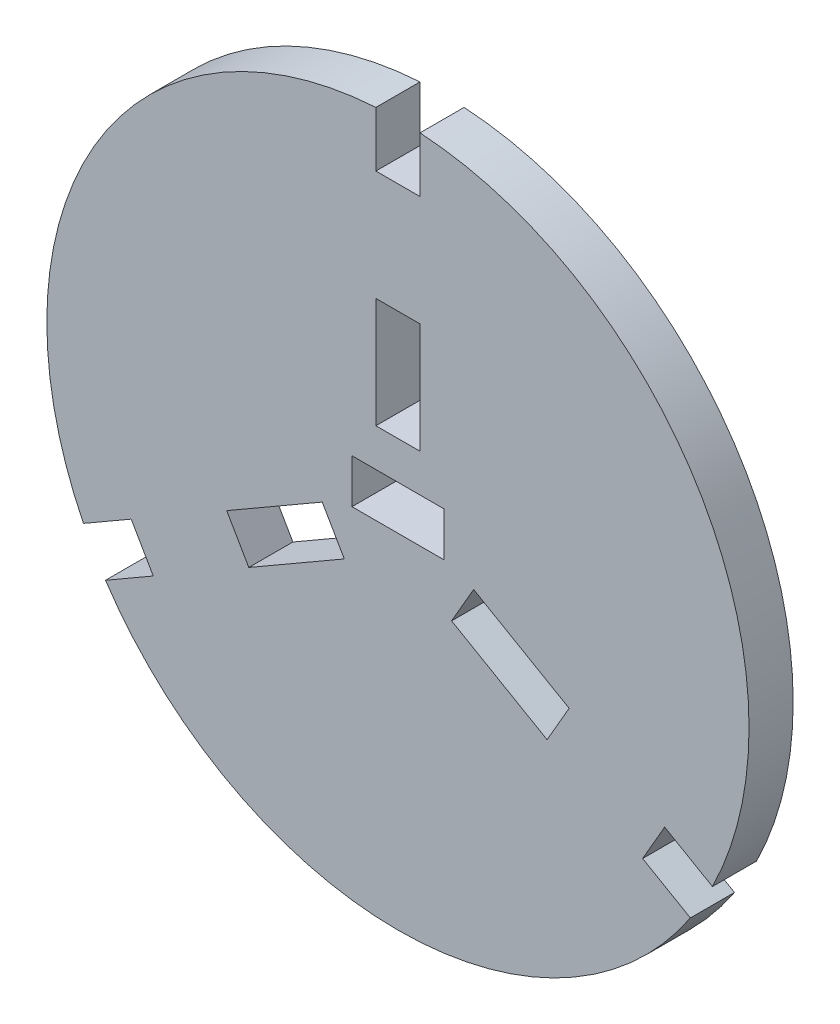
ISO-10303-21;
HEADER;
FILE_DESCRIPTION(('STEP AP214'),'2;1');
FILE_NAME('part.step','',(''),(''),'','','');
FILE_SCHEMA(('AUTOMOTIVE_DESIGN { 1 0 10303 214 1 1 1 1 }'));
ENDSEC;
DATA;
#1=APPLICATION_CONTEXT('core data for automotive mechanical design processes');
#2=APPLICATION_PROTOCOL_DEFINITION('international standard','automotive_design',2000,#1);
#3=PRODUCT_CONTEXT('',#1,'mechanical');
#4=PRODUCT('Part','Part','',(#3));
#5=PRODUCT_RELATED_PRODUCT_CATEGORY('part','',(#4));
#6=PRODUCT_DEFINITION_FORMATION('','',#4);
#7=PRODUCT_DEFINITION_CONTEXT('part definition',#1,'design');
#8=PRODUCT_DEFINITION('design','',#6,#7);
#9=PRODUCT_DEFINITION_SHAPE('','',#8);
#10=(LENGTH_UNIT() NAMED_UNIT(*) SI_UNIT(.MILLI.,.METRE.));
#11=(NAMED_UNIT(*) PLANE_ANGLE_UNIT() SI_UNIT($,.RADIAN.));
#12=(NAMED_UNIT(*) SI_UNIT($,.STERADIAN.) SOLID_ANGLE_UNIT());
#13=UNCERTAINTY_MEASURE_WITH_UNIT(LENGTH_MEASURE(1.E-05),#10,'distance_accuracy_value','');
#14=(GEOMETRIC_REPRESENTATION_CONTEXT(3) GLOBAL_UNCERTAINTY_ASSIGNED_CONTEXT((#13)) GLOBAL_UNIT_ASSIGNED_CONTEXT((#10,
#11,#12)) REPRESENTATION_CONTEXT('',''));
#15=CARTESIAN_POINT('',(0.,0.,0.));
#16=DIRECTION('',(0.,0.,1.));
#17=DIRECTION('',(1.,0.,0.));
#18=AXIS2_PLACEMENT_3D('',#15,#16,#17);
#19=CARTESIAN_POINT('',(0.,0.,12.));
#20=DIRECTION('',(0.,0.,1.));
#21=DIRECTION('',(1.,0.,0.));
#22=AXIS2_PLACEMENT_3D('',#19,#20,#21);
#23=PLANE('',#22);
#24=DIRECTION('',(0.,1.,0.));
#25=VECTOR('',#24,1.);
#26=CARTESIAN_POINT('',(12.5,10.,12.));
#27=LINE('',#26,#25);
#28=CARTESIAN_POINT('',(12.5,-2.,12.));
#29=VERTEX_POINT('',#28);
#30=CARTESIAN_POINT('',(12.5,10.,12.));
#31=VERTEX_POINT('',#30);
#32=EDGE_CURVE('E58',#29,#31,#27,.T.);
#33=ORIENTED_EDGE('',*,*,#32,.F.);
#34=DIRECTION('',(1.,0.,0.));
#35=VECTOR('',#34,1.);
#36=CARTESIAN_POINT('',(-12.5,-2.,12.));
#37=LINE('',#36,#35);
#38=CARTESIAN_POINT('',(-12.5,-2.,12.));
#39=VERTEX_POINT('',#38);
#40=EDGE_CURVE('E246',#39,#29,#37,.T.);
#41=ORIENTED_EDGE('',*,*,#40,.F.);
#42=DIRECTION('',(0.,-1.,0.));
#43=VECTOR('',#42,1.);
#44=CARTESIAN_POINT('',(-12.5,10.,12.));
#45=LINE('',#44,#43);
#46=CARTESIAN_POINT('',(-12.5,10.,12.));
#47=VERTEX_POINT('',#46);
#48=EDGE_CURVE('E231',#47,#39,#45,.T.);
#49=ORIENTED_EDGE('',*,*,#48,.F.);
#50=DIRECTION('',(-1.,0.,0.));
#51=VECTOR('',#50,1.);
#52=CARTESIAN_POINT('',(-12.5,10.,12.));
#53=LINE('',#52,#51);
#54=EDGE_CURVE('E240',#31,#47,#53,.T.);
#55=ORIENTED_EDGE('',*,*,#54,.F.);
#56=EDGE_LOOP('',(#33,#41,#49,#55));
#57=FACE_BOUND('',#56,.T.);
#58=CARTESIAN_POINT('',(0.,0.,12.));
#59=DIRECTION('',(0.,0.,1.));
#60=DIRECTION('',(1.,0.,0.));
#61=AXIS2_PLACEMENT_3D('',#58,#59,#60);
#62=CIRCLE('',#61,95.5);
#63=CARTESIAN_POINT('',(-6.,95.311331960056,12.));
#64=VERTEX_POINT('',#63);
#65=CARTESIAN_POINT('',(-85.5420347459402,-42.4595135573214,12.));
#66=VERTEX_POINT('',#65);
#67=EDGE_CURVE('E349',#64,#66,#62,.T.);
#68=ORIENTED_EDGE('',*,*,#67,.T.);
#69=DIRECTION('',(0.866025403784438,0.500000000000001,0.));
#70=VECTOR('',#69,1.);
#71=CARTESIAN_POINT('',(-85.5420347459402,-42.4595135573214,12.));
#72=LINE('',#71,#70);
#73=CARTESIAN_POINT('',(-72.5516536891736,-34.9595135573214,12.));
#74=VERTEX_POINT('',#73);
#75=EDGE_CURVE('E352',#66,#74,#72,.T.);
#76=ORIENTED_EDGE('',*,*,#75,.T.);
#77=DIRECTION('',(0.5,-0.866025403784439,0.));
#78=VECTOR('',#77,1.);
#79=CARTESIAN_POINT('',(-66.5516536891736,-45.3518184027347,12.));
#80=LINE('',#79,#78);
#81=CARTESIAN_POINT('',(-66.5516536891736,-45.3518184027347,12.));
#82=VERTEX_POINT('',#81);
#83=EDGE_CURVE('E355',#74,#82,#80,.T.);
#84=ORIENTED_EDGE('',*,*,#83,.T.);
#85=DIRECTION('',(-0.866025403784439,-0.5,0.));
#86=VECTOR('',#85,1.);
#87=CARTESIAN_POINT('',(-79.5420347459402,-52.8518184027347,12.));
#88=LINE('',#87,#86);
#89=CARTESIAN_POINT('',(-79.5420347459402,-52.8518184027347,12.));
#90=VERTEX_POINT('',#89);
#91=EDGE_CURVE('E357',#82,#90,#88,.T.);
#92=ORIENTED_EDGE('',*,*,#91,.T.);
#93=CARTESIAN_POINT('',(0.,0.,12.));
#94=DIRECTION('',(0.,0.,1.));
#95=DIRECTION('',(1.,0.,0.));
#96=AXIS2_PLACEMENT_3D('',#93,#94,#95);
#97=CIRCLE('',#96,95.5);
#98=CARTESIAN_POINT('',(79.5420347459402,-52.8518184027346,12.));
#99=VERTEX_POINT('',#98);
#100=EDGE_CURVE('E359',#90,#99,#97,.T.);
#101=ORIENTED_EDGE('',*,*,#100,.T.);
#102=DIRECTION('',(-0.866025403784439,0.5,0.));
#103=VECTOR('',#102,1.);
#104=CARTESIAN_POINT('',(79.5420347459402,-52.8518184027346,12.));
#105=LINE('',#104,#103);
#106=CARTESIAN_POINT('',(66.5516536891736,-45.3518184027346,12.));
#107=VERTEX_POINT('',#106);
#108=EDGE_CURVE('E361',#99,#107,#105,.T.);
#109=ORIENTED_EDGE('',*,*,#108,.T.);
#110=DIRECTION('',(0.5,0.866025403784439,0.));
#111=VECTOR('',#110,1.);
#112=CARTESIAN_POINT('',(72.5516536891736,-34.9595135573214,12.));
#113=LINE('',#112,#111);
#114=CARTESIAN_POINT('',(72.5516536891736,-34.9595135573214,12.));
#115=VERTEX_POINT('',#114);
#116=EDGE_CURVE('E363',#107,#115,#113,.T.);
#117=ORIENTED_EDGE('',*,*,#116,.T.);
#118=DIRECTION('',(0.866025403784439,-0.499999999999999,0.));
#119=VECTOR('',#118,1.);
#120=CARTESIAN_POINT('',(85.5420347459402,-42.4595135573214,12.));
#121=LINE('',#120,#119);
#122=CARTESIAN_POINT('',(85.5420347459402,-42.4595135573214,12.));
#123=VERTEX_POINT('',#122);
#124=EDGE_CURVE('E365',#115,#123,#121,.T.);
#125=ORIENTED_EDGE('',*,*,#124,.T.);
#126=CARTESIAN_POINT('',(0.,0.,12.));
#127=DIRECTION('',(0.,0.,1.));
#128=DIRECTION('',(1.,0.,0.));
#129=AXIS2_PLACEMENT_3D('',#126,#127,#128);
#130=CIRCLE('',#129,95.5);
#131=CARTESIAN_POINT('',(6.,95.311331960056,12.));
#132=VERTEX_POINT('',#131);
#133=EDGE_CURVE('E367',#123,#132,#130,.T.);
#134=ORIENTED_EDGE('',*,*,#133,.T.);
#135=DIRECTION('',(0.,-1.,0.));
#136=VECTOR('',#135,1.);
#137=CARTESIAN_POINT('',(6.,95.311331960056,12.));
#138=LINE('',#137,#136);
#139=CARTESIAN_POINT('',(6.,80.311331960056,12.));
#140=VERTEX_POINT('',#139);
#141=EDGE_CURVE('E369',#132,#140,#138,.T.);
#142=ORIENTED_EDGE('',*,*,#141,.T.);
#143=DIRECTION('',(-1.,0.,0.));
#144=VECTOR('',#143,1.);
#145=CARTESIAN_POINT('',(-6.,80.311331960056,12.));
#146=LINE('',#145,#144);
#147=CARTESIAN_POINT('',(-6.,80.311331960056,12.));
#148=VERTEX_POINT('',#147);
#149=EDGE_CURVE('E371',#140,#148,#146,.T.);
#150=ORIENTED_EDGE('',*,*,#149,.T.);
#151=DIRECTION('',(0.,1.,0.));
#152=VECTOR('',#151,1.);
#153=CARTESIAN_POINT('',(-6.,95.311331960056,12.));
#154=LINE('',#153,#152);
#155=EDGE_CURVE('E373',#148,#64,#154,.T.);
#156=ORIENTED_EDGE('',*,*,#155,.T.);
#157=EDGE_LOOP('',(#68,#76,#84,#92,#101,#109,#117,#125,#134,#142,#150,#156));
#158=FACE_BOUND('',#157,.T.);
#159=DIRECTION('',(1.,0.,0.));
#160=VECTOR('',#159,1.);
#161=CARTESIAN_POINT('',(-6.00000000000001,20.311331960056,12.));
#162=LINE('',#161,#160);
#163=CARTESIAN_POINT('',(-6.00000000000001,20.311331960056,12.));
#164=VERTEX_POINT('',#163);
#165=CARTESIAN_POINT('',(5.99999999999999,20.311331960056,12.));
#166=VERTEX_POINT('',#165);
#167=EDGE_CURVE('E320',#164,#166,#162,.T.);
#168=ORIENTED_EDGE('',*,*,#167,.F.);
#169=DIRECTION('',(0.,-1.,0.));
#170=VECTOR('',#169,1.);
#171=CARTESIAN_POINT('',(-6.00000000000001,50.311331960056,12.));
#172=LINE('',#171,#170);
#173=CARTESIAN_POINT('',(-6.00000000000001,50.311331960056,12.));
#174=VERTEX_POINT('',#173);
#175=EDGE_CURVE('E318',#174,#164,#172,.T.);
#176=ORIENTED_EDGE('',*,*,#175,.F.);
#177=DIRECTION('',(-1.,0.,0.));
#178=VECTOR('',#177,1.);
#179=CARTESIAN_POINT('',(-6.00000000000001,50.311331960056,12.));
#180=LINE('',#179,#178);
#181=CARTESIAN_POINT('',(5.99999999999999,50.311331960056,12.));
#182=VERTEX_POINT('',#181);
#183=EDGE_CURVE('E326',#182,#174,#180,.T.);
#184=ORIENTED_EDGE('',*,*,#183,.F.);
#185=DIRECTION('',(0.,1.,0.));
#186=VECTOR('',#185,1.);
#187=CARTESIAN_POINT('',(5.99999999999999,50.311331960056,12.));
#188=LINE('',#187,#186);
#189=EDGE_CURVE('E323',#166,#182,#188,.T.);
#190=ORIENTED_EDGE('',*,*,#189,.F.);
#191=EDGE_LOOP('',(#168,#176,#184,#190));
#192=FACE_BOUND('',#191,.T.);
#193=DIRECTION('',(-0.499999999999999,-0.866025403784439,0.));
#194=VECTOR('',#193,1.);
#195=CARTESIAN_POINT('',(20.5901294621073,-4.95951355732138,12.));
#196=LINE('',#195,#194);
#197=CARTESIAN_POINT('',(20.5901294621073,-4.95951355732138,12.));
#198=VERTEX_POINT('',#197);
#199=CARTESIAN_POINT('',(14.5901294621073,-15.3518184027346,12.));
#200=VERTEX_POINT('',#199);
#201=EDGE_CURVE('E289',#198,#200,#196,.T.);
#202=ORIENTED_EDGE('',*,*,#201,.F.);
#203=DIRECTION('',(-0.866025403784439,0.5,0.));
#204=VECTOR('',#203,1.);
#205=CARTESIAN_POINT('',(46.5708915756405,-19.9595135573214,12.));
#206=LINE('',#205,#204);
#207=CARTESIAN_POINT('',(46.5708915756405,-19.9595135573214,12.));
#208=VERTEX_POINT('',#207);
#209=EDGE_CURVE('E287',#208,#198,#206,.T.);
#210=ORIENTED_EDGE('',*,*,#209,.F.);
#211=DIRECTION('',(0.5,0.866025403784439,0.));
#212=VECTOR('',#211,1.);
#213=CARTESIAN_POINT('',(46.5708915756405,-19.9595135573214,12.));
#214=LINE('',#213,#212);
#215=CARTESIAN_POINT('',(40.5708915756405,-30.3518184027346,12.));
#216=VERTEX_POINT('',#215);
#217=EDGE_CURVE('E295',#216,#208,#214,.T.);
#218=ORIENTED_EDGE('',*,*,#217,.F.);
#219=DIRECTION('',(0.866025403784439,-0.5,0.));
#220=VECTOR('',#219,1.);
#221=CARTESIAN_POINT('',(40.5708915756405,-30.3518184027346,12.));
#222=LINE('',#221,#220);
#223=EDGE_CURVE('E292',#200,#216,#222,.T.);
#224=ORIENTED_EDGE('',*,*,#223,.F.);
#225=EDGE_LOOP('',(#202,#210,#218,#224));
#226=FACE_BOUND('',#225,.T.);
#227=DIRECTION('',(-0.5,0.866025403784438,0.));
#228=VECTOR('',#227,1.);
#229=CARTESIAN_POINT('',(-14.5901294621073,-15.3518184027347,12.));
#230=LINE('',#229,#228);
#231=CARTESIAN_POINT('',(-14.5901294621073,-15.3518184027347,12.));
#232=VERTEX_POINT('',#231);
#233=CARTESIAN_POINT('',(-20.5901294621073,-4.9595135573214,12.));
#234=VERTEX_POINT('',#233);
#235=EDGE_CURVE('E258',#232,#234,#230,.T.);
#236=ORIENTED_EDGE('',*,*,#235,.F.);
#237=DIRECTION('',(0.866025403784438,0.5,0.));
#238=VECTOR('',#237,1.);
#239=CARTESIAN_POINT('',(-40.5708915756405,-30.3518184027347,12.));
#240=LINE('',#239,#238);
#241=CARTESIAN_POINT('',(-40.5708915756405,-30.3518184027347,12.));
#242=VERTEX_POINT('',#241);
#243=EDGE_CURVE('E256',#242,#232,#240,.T.);
#244=ORIENTED_EDGE('',*,*,#243,.F.);
#245=DIRECTION('',(0.5,-0.866025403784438,0.));
#246=VECTOR('',#245,1.);
#247=CARTESIAN_POINT('',(-40.5708915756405,-30.3518184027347,12.));
#248=LINE('',#247,#246);
#249=CARTESIAN_POINT('',(-46.5708915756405,-19.9595135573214,12.));
#250=VERTEX_POINT('',#249);
#251=EDGE_CURVE('E264',#250,#242,#248,.T.);
#252=ORIENTED_EDGE('',*,*,#251,.F.);
#253=DIRECTION('',(-0.866025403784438,-0.5,0.));
#254=VECTOR('',#253,1.);
#255=CARTESIAN_POINT('',(-46.5708915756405,-19.9595135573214,12.));
#256=LINE('',#255,#254);
#257=EDGE_CURVE('E261',#234,#250,#256,.T.);
#258=ORIENTED_EDGE('',*,*,#257,.F.);
#259=EDGE_LOOP('',(#236,#244,#252,#258));
#260=FACE_BOUND('',#259,.T.);
#261=ADVANCED_FACE('F43',(#57,#158,#192,#226,#260),#23,.T.);
#262=CARTESIAN_POINT('',(0.,0.,0.));
#263=DIRECTION('',(0.,0.,1.));
#264=DIRECTION('',(1.,0.,0.));
#265=AXIS2_PLACEMENT_3D('',#262,#263,#264);
#266=PLANE('',#265);
#267=DIRECTION('',(1.,0.,0.));
#268=VECTOR('',#267,1.);
#269=CARTESIAN_POINT('',(0.,-2.,0.));
#270=LINE('',#269,#268);
#271=CARTESIAN_POINT('',(-12.5,-2.,0.));
#272=VERTEX_POINT('',#271);
#273=CARTESIAN_POINT('',(12.5,-2.,0.));
#274=VERTEX_POINT('',#273);
#275=EDGE_CURVE('E51',#272,#274,#270,.T.);
#276=ORIENTED_EDGE('',*,*,#275,.T.);
#277=DIRECTION('',(0.,1.,0.));
#278=VECTOR('',#277,1.);
#279=CARTESIAN_POINT('',(12.5,0.,0.));
#280=LINE('',#279,#278);
#281=CARTESIAN_POINT('',(12.5,10.,0.));
#282=VERTEX_POINT('',#281);
#283=EDGE_CURVE('E11',#274,#282,#280,.T.);
#284=ORIENTED_EDGE('',*,*,#283,.T.);
#285=DIRECTION('',(-1.,0.,0.));
#286=VECTOR('',#285,1.);
#287=CARTESIAN_POINT('',(0.,10.,0.));
#288=LINE('',#287,#286);
#289=CARTESIAN_POINT('',(-12.5,10.,0.));
#290=VERTEX_POINT('',#289);
#291=EDGE_CURVE('E434',#282,#290,#288,.T.);
#292=ORIENTED_EDGE('',*,*,#291,.T.);
#293=DIRECTION('',(0.,-1.,0.));
#294=VECTOR('',#293,1.);
#295=CARTESIAN_POINT('',(-12.5,0.,0.));
#296=LINE('',#295,#294);
#297=EDGE_CURVE('E234',#290,#272,#296,.T.);
#298=ORIENTED_EDGE('',*,*,#297,.T.);
#299=EDGE_LOOP('',(#276,#284,#292,#298));
#300=FACE_BOUND('',#299,.T.);
#301=DIRECTION('',(-0.866025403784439,0.5,0.));
#302=VECTOR('',#301,1.);
#303=CARTESIAN_POINT('',(46.5708915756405,-19.9595135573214,0.));
#304=LINE('',#303,#302);
#305=CARTESIAN_POINT('',(46.5708915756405,-19.9595135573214,0.));
#306=VERTEX_POINT('',#305);
#307=CARTESIAN_POINT('',(20.5901294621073,-4.95951355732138,0.));
#308=VERTEX_POINT('',#307);
#309=EDGE_CURVE('E286',#306,#308,#304,.T.);
#310=ORIENTED_EDGE('',*,*,#309,.T.);
#311=DIRECTION('',(-0.499999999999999,-0.866025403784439,0.));
#312=VECTOR('',#311,1.);
#313=CARTESIAN_POINT('',(20.5901294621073,-4.95951355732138,0.));
#314=LINE('',#313,#312);
#315=CARTESIAN_POINT('',(14.5901294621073,-15.3518184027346,0.));
#316=VERTEX_POINT('',#315);
#317=EDGE_CURVE('E300',#308,#316,#314,.T.);
#318=ORIENTED_EDGE('',*,*,#317,.T.);
#319=DIRECTION('',(0.866025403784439,-0.5,0.));
#320=VECTOR('',#319,1.);
#321=CARTESIAN_POINT('',(40.5708915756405,-30.3518184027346,0.));
#322=LINE('',#321,#320);
#323=CARTESIAN_POINT('',(40.5708915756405,-30.3518184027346,0.));
#324=VERTEX_POINT('',#323);
#325=EDGE_CURVE('E303',#316,#324,#322,.T.);
#326=ORIENTED_EDGE('',*,*,#325,.T.);
#327=DIRECTION('',(0.5,0.866025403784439,0.));
#328=VECTOR('',#327,1.);
#329=CARTESIAN_POINT('',(46.5708915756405,-19.9595135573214,0.));
#330=LINE('',#329,#328);
#331=EDGE_CURVE('E290',#324,#306,#330,.T.);
#332=ORIENTED_EDGE('',*,*,#331,.T.);
#333=EDGE_LOOP('',(#310,#318,#326,#332));
#334=FACE_BOUND('',#333,.T.);
#335=CARTESIAN_POINT('',(0.,0.,0.));
#336=DIRECTION('',(0.,0.,1.));
#337=DIRECTION('',(1.,0.,0.));
#338=AXIS2_PLACEMENT_3D('',#335,#336,#337);
#339=CIRCLE('',#338,95.5);
#340=CARTESIAN_POINT('',(-6.,95.311331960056,0.));
#341=VERTEX_POINT('',#340);
#342=CARTESIAN_POINT('',(-85.5420347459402,-42.4595135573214,0.));
#343=VERTEX_POINT('',#342);
#344=EDGE_CURVE('E348',#341,#343,#339,.T.);
#345=ORIENTED_EDGE('',*,*,#344,.F.);
#346=DIRECTION('',(0.,1.,0.));
#347=VECTOR('',#346,1.);
#348=CARTESIAN_POINT('',(-6.,95.311331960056,0.));
#349=LINE('',#348,#347);
#350=CARTESIAN_POINT('',(-6.,80.311331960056,0.));
#351=VERTEX_POINT('',#350);
#352=EDGE_CURVE('E353',#351,#341,#349,.T.);
#353=ORIENTED_EDGE('',*,*,#352,.F.);
#354=DIRECTION('',(-1.,0.,0.));
#355=VECTOR('',#354,1.);
#356=CARTESIAN_POINT('',(-6.,80.311331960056,0.));
#357=LINE('',#356,#355);
#358=CARTESIAN_POINT('',(6.,80.311331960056,0.));
#359=VERTEX_POINT('',#358);
#360=EDGE_CURVE('E396',#359,#351,#357,.T.);
#361=ORIENTED_EDGE('',*,*,#360,.F.);
#362=DIRECTION('',(0.,-1.,0.));
#363=VECTOR('',#362,1.);
#364=CARTESIAN_POINT('',(6.,95.311331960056,0.));
#365=LINE('',#364,#363);
#366=CARTESIAN_POINT('',(6.,95.311331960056,0.));
#367=VERTEX_POINT('',#366);
#368=EDGE_CURVE('E394',#367,#359,#365,.T.);
#369=ORIENTED_EDGE('',*,*,#368,.F.);
#370=CARTESIAN_POINT('',(0.,0.,0.));
#371=DIRECTION('',(0.,0.,1.));
#372=DIRECTION('',(1.,0.,0.));
#373=AXIS2_PLACEMENT_3D('',#370,#371,#372);
#374=CIRCLE('',#373,95.5);
#375=CARTESIAN_POINT('',(85.5420347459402,-42.4595135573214,0.));
#376=VERTEX_POINT('',#375);
#377=EDGE_CURVE('E392',#376,#367,#374,.T.);
#378=ORIENTED_EDGE('',*,*,#377,.F.);
#379=DIRECTION('',(0.866025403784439,-0.499999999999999,0.));
#380=VECTOR('',#379,1.);
#381=CARTESIAN_POINT('',(85.5420347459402,-42.4595135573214,0.));
#382=LINE('',#381,#380);
#383=CARTESIAN_POINT('',(72.5516536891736,-34.9595135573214,0.));
#384=VERTEX_POINT('',#383);
#385=EDGE_CURVE('E390',#384,#376,#382,.T.);
#386=ORIENTED_EDGE('',*,*,#385,.F.);
#387=DIRECTION('',(0.5,0.866025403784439,0.));
#388=VECTOR('',#387,1.);
#389=CARTESIAN_POINT('',(72.5516536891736,-34.9595135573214,0.));
#390=LINE('',#389,#388);
#391=CARTESIAN_POINT('',(66.5516536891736,-45.3518184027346,0.));
#392=VERTEX_POINT('',#391);
#393=EDGE_CURVE('E388',#392,#384,#390,.T.);
#394=ORIENTED_EDGE('',*,*,#393,.F.);
#395=DIRECTION('',(-0.866025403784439,0.5,0.));
#396=VECTOR('',#395,1.);
#397=CARTESIAN_POINT('',(79.5420347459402,-52.8518184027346,0.));
#398=LINE('',#397,#396);
#399=CARTESIAN_POINT('',(79.5420347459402,-52.8518184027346,0.));
#400=VERTEX_POINT('',#399);
#401=EDGE_CURVE('E386',#400,#392,#398,.T.);
#402=ORIENTED_EDGE('',*,*,#401,.F.);
#403=CARTESIAN_POINT('',(0.,0.,0.));
#404=DIRECTION('',(0.,0.,1.));
#405=DIRECTION('',(1.,0.,0.));
#406=AXIS2_PLACEMENT_3D('',#403,#404,#405);
#407=CIRCLE('',#406,95.5);
#408=CARTESIAN_POINT('',(-79.5420347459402,-52.8518184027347,0.));
#409=VERTEX_POINT('',#408);
#410=EDGE_CURVE('E384',#409,#400,#407,.T.);
#411=ORIENTED_EDGE('',*,*,#410,.F.);
#412=DIRECTION('',(-0.866025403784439,-0.5,0.));
#413=VECTOR('',#412,1.);
#414=CARTESIAN_POINT('',(-79.5420347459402,-52.8518184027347,0.));
#415=LINE('',#414,#413);
#416=CARTESIAN_POINT('',(-66.5516536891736,-45.3518184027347,0.));
#417=VERTEX_POINT('',#416);
#418=EDGE_CURVE('E382',#417,#409,#415,.T.);
#419=ORIENTED_EDGE('',*,*,#418,.F.);
#420=DIRECTION('',(0.5,-0.866025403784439,0.));
#421=VECTOR('',#420,1.);
#422=CARTESIAN_POINT('',(-66.5516536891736,-45.3518184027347,0.));
#423=LINE('',#422,#421);
#424=CARTESIAN_POINT('',(-72.5516536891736,-34.9595135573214,0.));
#425=VERTEX_POINT('',#424);
#426=EDGE_CURVE('E380',#425,#417,#423,.T.);
#427=ORIENTED_EDGE('',*,*,#426,.F.);
#428=DIRECTION('',(0.866025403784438,0.500000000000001,0.));
#429=VECTOR('',#428,1.);
#430=CARTESIAN_POINT('',(-85.5420347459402,-42.4595135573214,0.));
#431=LINE('',#430,#429);
#432=EDGE_CURVE('E378',#343,#425,#431,.T.);
#433=ORIENTED_EDGE('',*,*,#432,.F.);
#434=EDGE_LOOP('',(#345,#353,#361,#369,#378,#386,#394,#402,#411,#419,#427,#433));
#435=FACE_BOUND('',#434,.T.);
#436=DIRECTION('',(0.,-1.,0.));
#437=VECTOR('',#436,1.);
#438=CARTESIAN_POINT('',(-6.00000000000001,50.311331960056,0.));
#439=LINE('',#438,#437);
#440=CARTESIAN_POINT('',(-6.00000000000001,50.311331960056,0.));
#441=VERTEX_POINT('',#440);
#442=CARTESIAN_POINT('',(-6.00000000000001,20.311331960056,0.));
#443=VERTEX_POINT('',#442);
#444=EDGE_CURVE('E317',#441,#443,#439,.T.);
#445=ORIENTED_EDGE('',*,*,#444,.T.);
#446=DIRECTION('',(1.,0.,0.));
#447=VECTOR('',#446,1.);
#448=CARTESIAN_POINT('',(-6.00000000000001,20.311331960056,0.));
#449=LINE('',#448,#447);
#450=CARTESIAN_POINT('',(5.99999999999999,20.311331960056,0.));
#451=VERTEX_POINT('',#450);
#452=EDGE_CURVE('E331',#443,#451,#449,.T.);
#453=ORIENTED_EDGE('',*,*,#452,.T.);
#454=DIRECTION('',(0.,1.,0.));
#455=VECTOR('',#454,1.);
#456=CARTESIAN_POINT('',(5.99999999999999,50.311331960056,0.));
#457=LINE('',#456,#455);
#458=CARTESIAN_POINT('',(5.99999999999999,50.311331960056,0.));
#459=VERTEX_POINT('',#458);
#460=EDGE_CURVE('E334',#451,#459,#457,.T.);
#461=ORIENTED_EDGE('',*,*,#460,.T.);
#462=DIRECTION('',(-1.,0.,0.));
#463=VECTOR('',#462,1.);
#464=CARTESIAN_POINT('',(-6.00000000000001,50.311331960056,0.));
#465=LINE('',#464,#463);
#466=EDGE_CURVE('E321',#459,#441,#465,.T.);
#467=ORIENTED_EDGE('',*,*,#466,.T.);
#468=EDGE_LOOP('',(#445,#453,#461,#467));
#469=FACE_BOUND('',#468,.T.);
#470=DIRECTION('',(0.866025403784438,0.5,0.));
#471=VECTOR('',#470,1.);
#472=CARTESIAN_POINT('',(-40.5708915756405,-30.3518184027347,0.));
#473=LINE('',#472,#471);
#474=CARTESIAN_POINT('',(-40.5708915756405,-30.3518184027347,0.));
#475=VERTEX_POINT('',#474);
#476=CARTESIAN_POINT('',(-14.5901294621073,-15.3518184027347,0.));
#477=VERTEX_POINT('',#476);
#478=EDGE_CURVE('E253',#475,#477,#473,.T.);
#479=ORIENTED_EDGE('',*,*,#478,.T.);
#480=DIRECTION('',(-0.5,0.866025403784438,0.));
#481=VECTOR('',#480,1.);
#482=CARTESIAN_POINT('',(-14.5901294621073,-15.3518184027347,0.));
#483=LINE('',#482,#481);
#484=CARTESIAN_POINT('',(-20.5901294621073,-4.9595135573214,0.));
#485=VERTEX_POINT('',#484);
#486=EDGE_CURVE('E269',#477,#485,#483,.T.);
#487=ORIENTED_EDGE('',*,*,#486,.T.);
#488=DIRECTION('',(-0.866025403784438,-0.5,0.));
#489=VECTOR('',#488,1.);
#490=CARTESIAN_POINT('',(-46.5708915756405,-19.9595135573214,0.));
#491=LINE('',#490,#489);
#492=CARTESIAN_POINT('',(-46.5708915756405,-19.9595135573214,0.));
#493=VERTEX_POINT('',#492);
#494=EDGE_CURVE('E272',#485,#493,#491,.T.);
#495=ORIENTED_EDGE('',*,*,#494,.T.);
#496=DIRECTION('',(0.5,-0.866025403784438,0.));
#497=VECTOR('',#496,1.);
#498=CARTESIAN_POINT('',(-40.5708915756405,-30.3518184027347,0.));
#499=LINE('',#498,#497);
#500=EDGE_CURVE('E259',#493,#475,#499,.T.);
#501=ORIENTED_EDGE('',*,*,#500,.T.);
#502=EDGE_LOOP('',(#479,#487,#495,#501));
#503=FACE_BOUND('',#502,.T.);
#504=ADVANCED_FACE('F438',(#300,#334,#435,#469,#503),#266,.F.);
#505=CARTESIAN_POINT('',(0.,0.,12.));
#506=DIRECTION('',(0.,0.,-1.));
#507=DIRECTION('',(-1.,0.,0.));
#508=AXIS2_PLACEMENT_3D('',#505,#506,#507);
#509=CYLINDRICAL_SURFACE('',#508,95.5);
#510=ORIENTED_EDGE('',*,*,#344,.T.);
#511=DIRECTION('',(0.,0.,-1.));
#512=VECTOR('',#511,1.);
#513=CARTESIAN_POINT('',(-85.5420347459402,-42.4595135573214,12.));
#514=LINE('',#513,#512);
#515=EDGE_CURVE('E431',#66,#343,#514,.T.);
#516=ORIENTED_EDGE('',*,*,#515,.F.);
#517=ORIENTED_EDGE('',*,*,#67,.F.);
#518=DIRECTION('',(0.,0.,-1.));
#519=VECTOR('',#518,1.);
#520=CARTESIAN_POINT('',(-6.,95.311331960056,12.));
#521=LINE('',#520,#519);
#522=EDGE_CURVE('E375',#64,#341,#521,.T.);
#523=ORIENTED_EDGE('',*,*,#522,.T.);
#524=EDGE_LOOP('',(#510,#516,#517,#523));
#525=FACE_BOUND('',#524,.T.);
#526=ADVANCED_FACE('F45',(#525),#509,.T.);
#527=CARTESIAN_POINT('',(-85.5420347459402,-42.4595135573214,12.));
#528=DIRECTION('',(-0.5,0.866025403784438,0.));
#529=DIRECTION('',(-0.866025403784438,-0.500000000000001,0.));
#530=AXIS2_PLACEMENT_3D('',#527,#528,#529);
#531=PLANE('',#530);
#532=ORIENTED_EDGE('',*,*,#432,.T.);
#533=DIRECTION('',(0.,0.,-1.));
#534=VECTOR('',#533,1.);
#535=CARTESIAN_POINT('',(-72.5516536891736,-34.9595135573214,12.));
#536=LINE('',#535,#534);
#537=EDGE_CURVE('E428',#74,#425,#536,.T.);
#538=ORIENTED_EDGE('',*,*,#537,.F.);
#539=ORIENTED_EDGE('',*,*,#75,.F.);
#540=ORIENTED_EDGE('',*,*,#515,.T.);
#541=EDGE_LOOP('',(#532,#538,#539,#540));
#542=FACE_BOUND('',#541,.T.);
#543=ADVANCED_FACE('F504',(#542),#531,.F.);
#544=CARTESIAN_POINT('',(-66.5516536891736,-45.3518184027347,12.));
#545=DIRECTION('',(0.866025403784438,0.5,0.));
#546=DIRECTION('',(-0.5,0.866025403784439,0.));
#547=AXIS2_PLACEMENT_3D('',#544,#545,#546);
#548=PLANE('',#547);
#549=ORIENTED_EDGE('',*,*,#426,.T.);
#550=DIRECTION('',(0.,0.,-1.));
#551=VECTOR('',#550,1.);
#552=CARTESIAN_POINT('',(-66.5516536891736,-45.3518184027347,12.));
#553=LINE('',#552,#551);
#554=EDGE_CURVE('E425',#82,#417,#553,.T.);
#555=ORIENTED_EDGE('',*,*,#554,.F.);
#556=ORIENTED_EDGE('',*,*,#83,.F.);
#557=ORIENTED_EDGE('',*,*,#537,.T.);
#558=EDGE_LOOP('',(#549,#555,#556,#557));
#559=FACE_BOUND('',#558,.T.);
#560=ADVANCED_FACE('F501',(#559),#548,.F.);
#561=CARTESIAN_POINT('',(-79.5420347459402,-52.8518184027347,12.));
#562=DIRECTION('',(0.5,-0.866025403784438,0.));
#563=DIRECTION('',(0.866025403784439,0.5,0.));
#564=AXIS2_PLACEMENT_3D('',#561,#562,#563);
#565=PLANE('',#564);
#566=ORIENTED_EDGE('',*,*,#418,.T.);
#567=DIRECTION('',(0.,0.,-1.));
#568=VECTOR('',#567,1.);
#569=CARTESIAN_POINT('',(-79.5420347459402,-52.8518184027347,12.));
#570=LINE('',#569,#568);
#571=EDGE_CURVE('E422',#90,#409,#570,.T.);
#572=ORIENTED_EDGE('',*,*,#571,.F.);
#573=ORIENTED_EDGE('',*,*,#91,.F.);
#574=ORIENTED_EDGE('',*,*,#554,.T.);
#575=EDGE_LOOP('',(#566,#572,#573,#574));
#576=FACE_BOUND('',#575,.T.);
#577=ADVANCED_FACE('F497',(#576),#565,.F.);
#578=CARTESIAN_POINT('',(0.,0.,12.));
#579=DIRECTION('',(0.,0.,-1.));
#580=DIRECTION('',(-1.,0.,0.));
#581=AXIS2_PLACEMENT_3D('',#578,#579,#580);
#582=CYLINDRICAL_SURFACE('',#581,95.5);
#583=ORIENTED_EDGE('',*,*,#410,.T.);
#584=DIRECTION('',(0.,0.,-1.));
#585=VECTOR('',#584,1.);
#586=CARTESIAN_POINT('',(79.5420347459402,-52.8518184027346,12.));
#587=LINE('',#586,#585);
#588=EDGE_CURVE('E419',#99,#400,#587,.T.);
#589=ORIENTED_EDGE('',*,*,#588,.F.);
#590=ORIENTED_EDGE('',*,*,#100,.F.);
#591=ORIENTED_EDGE('',*,*,#571,.T.);
#592=EDGE_LOOP('',(#583,#589,#590,#591));
#593=FACE_BOUND('',#592,.T.);
#594=ADVANCED_FACE('F493',(#593),#582,.T.);
#595=CARTESIAN_POINT('',(79.5420347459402,-52.8518184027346,12.));
#596=DIRECTION('',(-0.5,-0.866025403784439,0.));
#597=DIRECTION('',(0.866025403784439,-0.5,0.));
#598=AXIS2_PLACEMENT_3D('',#595,#596,#597);
#599=PLANE('',#598);
#600=ORIENTED_EDGE('',*,*,#401,.T.);
#601=DIRECTION('',(0.,0.,-1.));
#602=VECTOR('',#601,1.);
#603=CARTESIAN_POINT('',(66.5516536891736,-45.3518184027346,12.));
#604=LINE('',#603,#602);
#605=EDGE_CURVE('E416',#107,#392,#604,.T.);
#606=ORIENTED_EDGE('',*,*,#605,.F.);
#607=ORIENTED_EDGE('',*,*,#108,.F.);
#608=ORIENTED_EDGE('',*,*,#588,.T.);
#609=EDGE_LOOP('',(#600,#606,#607,#608));
#610=FACE_BOUND('',#609,.T.);
#611=ADVANCED_FACE('F489',(#610),#599,.F.);
#612=CARTESIAN_POINT('',(72.5516536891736,-34.9595135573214,12.));
#613=DIRECTION('',(-0.866025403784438,0.5,0.));
#614=DIRECTION('',(-0.5,-0.866025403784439,0.));
#615=AXIS2_PLACEMENT_3D('',#612,#613,#614);
#616=PLANE('',#615);
#617=ORIENTED_EDGE('',*,*,#393,.T.);
#618=DIRECTION('',(0.,0.,-1.));
#619=VECTOR('',#618,1.);
#620=CARTESIAN_POINT('',(72.5516536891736,-34.9595135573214,12.));
#621=LINE('',#620,#619);
#622=EDGE_CURVE('E413',#115,#384,#621,.T.);
#623=ORIENTED_EDGE('',*,*,#622,.F.);
#624=ORIENTED_EDGE('',*,*,#116,.F.);
#625=ORIENTED_EDGE('',*,*,#605,.T.);
#626=EDGE_LOOP('',(#617,#623,#624,#625));
#627=FACE_BOUND('',#626,.T.);
#628=ADVANCED_FACE('F485',(#627),#616,.F.);
#629=CARTESIAN_POINT('',(85.5420347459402,-42.4595135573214,12.));
#630=DIRECTION('',(0.499999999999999,0.866025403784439,0.));
#631=DIRECTION('',(-0.866025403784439,0.499999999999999,0.));
#632=AXIS2_PLACEMENT_3D('',#629,#630,#631);
#633=PLANE('',#632);
#634=ORIENTED_EDGE('',*,*,#385,.T.);
#635=DIRECTION('',(0.,0.,-1.));
#636=VECTOR('',#635,1.);
#637=CARTESIAN_POINT('',(85.5420347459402,-42.4595135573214,12.));
#638=LINE('',#637,#636);
#639=EDGE_CURVE('E410',#123,#376,#638,.T.);
#640=ORIENTED_EDGE('',*,*,#639,.F.);
#641=ORIENTED_EDGE('',*,*,#124,.F.);
#642=ORIENTED_EDGE('',*,*,#622,.T.);
#643=EDGE_LOOP('',(#634,#640,#641,#642));
#644=FACE_BOUND('',#643,.T.);
#645=ADVANCED_FACE('F481',(#644),#633,.F.);
#646=CARTESIAN_POINT('',(0.,0.,12.));
#647=DIRECTION('',(0.,0.,-1.));
#648=DIRECTION('',(-1.,0.,0.));
#649=AXIS2_PLACEMENT_3D('',#646,#647,#648);
#650=CYLINDRICAL_SURFACE('',#649,95.5);
#651=ORIENTED_EDGE('',*,*,#377,.T.);
#652=DIRECTION('',(0.,0.,-1.));
#653=VECTOR('',#652,1.);
#654=CARTESIAN_POINT('',(6.,95.311331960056,12.));
#655=LINE('',#654,#653);
#656=EDGE_CURVE('E407',#132,#367,#655,.T.);
#657=ORIENTED_EDGE('',*,*,#656,.F.);
#658=ORIENTED_EDGE('',*,*,#133,.F.);
#659=ORIENTED_EDGE('',*,*,#639,.T.);
#660=EDGE_LOOP('',(#651,#657,#658,#659));
#661=FACE_BOUND('',#660,.T.);
#662=ADVANCED_FACE('F477',(#661),#650,.T.);
#663=CARTESIAN_POINT('',(6.,95.311331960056,12.));
#664=DIRECTION('',(1.,0.,0.));
#665=DIRECTION('',(0.,0.,-1.));
#666=AXIS2_PLACEMENT_3D('',#663,#664,#665);
#667=PLANE('',#666);
#668=ORIENTED_EDGE('',*,*,#368,.T.);
#669=DIRECTION('',(0.,0.,-1.));
#670=VECTOR('',#669,1.);
#671=CARTESIAN_POINT('',(6.,80.311331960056,12.));
#672=LINE('',#671,#670);
#673=EDGE_CURVE('E404',#140,#359,#672,.T.);
#674=ORIENTED_EDGE('',*,*,#673,.F.);
#675=ORIENTED_EDGE('',*,*,#141,.F.);
#676=ORIENTED_EDGE('',*,*,#656,.T.);
#677=EDGE_LOOP('',(#668,#674,#675,#676));
#678=FACE_BOUND('',#677,.T.);
#679=ADVANCED_FACE('F473',(#678),#667,.F.);
#680=CARTESIAN_POINT('',(-6.,80.311331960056,12.));
#681=DIRECTION('',(0.,-1.,0.));
#682=DIRECTION('',(0.,0.,-1.));
#683=AXIS2_PLACEMENT_3D('',#680,#681,#682);
#684=PLANE('',#683);
#685=ORIENTED_EDGE('',*,*,#360,.T.);
#686=DIRECTION('',(0.,0.,-1.));
#687=VECTOR('',#686,1.);
#688=CARTESIAN_POINT('',(-6.,80.311331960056,12.));
#689=LINE('',#688,#687);
#690=EDGE_CURVE('E401',#148,#351,#689,.T.);
#691=ORIENTED_EDGE('',*,*,#690,.F.);
#692=ORIENTED_EDGE('',*,*,#149,.F.);
#693=ORIENTED_EDGE('',*,*,#673,.T.);
#694=EDGE_LOOP('',(#685,#691,#692,#693));
#695=FACE_BOUND('',#694,.T.);
#696=ADVANCED_FACE('F469',(#695),#684,.F.);
#697=CARTESIAN_POINT('',(-6.,95.311331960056,12.));
#698=DIRECTION('',(-1.,0.,0.));
#699=DIRECTION('',(0.,0.,1.));
#700=AXIS2_PLACEMENT_3D('',#697,#698,#699);
#701=PLANE('',#700);
#702=ORIENTED_EDGE('',*,*,#352,.T.);
#703=ORIENTED_EDGE('',*,*,#522,.F.);
#704=ORIENTED_EDGE('',*,*,#155,.F.);
#705=ORIENTED_EDGE('',*,*,#690,.T.);
#706=EDGE_LOOP('',(#702,#703,#704,#705));
#707=FACE_BOUND('',#706,.T.);
#708=ADVANCED_FACE('F466',(#707),#701,.F.);
#709=CARTESIAN_POINT('',(-6.00000000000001,50.311331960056,12.));
#710=DIRECTION('',(1.,0.,0.));
#711=DIRECTION('',(0.,1.,0.));
#712=AXIS2_PLACEMENT_3D('',#709,#710,#711);
#713=PLANE('',#712);
#714=ORIENTED_EDGE('',*,*,#444,.F.);
#715=DIRECTION('',(0.,0.,-1.));
#716=VECTOR('',#715,1.);
#717=CARTESIAN_POINT('',(-6.00000000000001,50.311331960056,12.));
#718=LINE('',#717,#716);
#719=EDGE_CURVE('E328',#174,#441,#718,.T.);
#720=ORIENTED_EDGE('',*,*,#719,.F.);
#721=ORIENTED_EDGE('',*,*,#175,.T.);
#722=DIRECTION('',(0.,0.,-1.));
#723=VECTOR('',#722,1.);
#724=CARTESIAN_POINT('',(-6.00000000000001,20.311331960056,12.));
#725=LINE('',#724,#723);
#726=EDGE_CURVE('E345',#164,#443,#725,.T.);
#727=ORIENTED_EDGE('',*,*,#726,.T.);
#728=EDGE_LOOP('',(#714,#720,#721,#727));
#729=FACE_BOUND('',#728,.T.);
#730=ADVANCED_FACE('F463',(#729),#713,.T.);
#731=CARTESIAN_POINT('',(-6.00000000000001,20.311331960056,12.));
#732=DIRECTION('',(0.,1.,0.));
#733=DIRECTION('',(0.,0.,1.));
#734=AXIS2_PLACEMENT_3D('',#731,#732,#733);
#735=PLANE('',#734);
#736=ORIENTED_EDGE('',*,*,#452,.F.);
#737=ORIENTED_EDGE('',*,*,#726,.F.);
#738=ORIENTED_EDGE('',*,*,#167,.T.);
#739=DIRECTION('',(0.,0.,-1.));
#740=VECTOR('',#739,1.);
#741=CARTESIAN_POINT('',(5.99999999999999,20.311331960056,12.));
#742=LINE('',#741,#740);
#743=EDGE_CURVE('E343',#166,#451,#742,.T.);
#744=ORIENTED_EDGE('',*,*,#743,.T.);
#745=EDGE_LOOP('',(#736,#737,#738,#744));
#746=FACE_BOUND('',#745,.T.);
#747=ADVANCED_FACE('F602',(#746),#735,.T.);
#748=CARTESIAN_POINT('',(5.99999999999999,50.311331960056,12.));
#749=DIRECTION('',(-1.,0.,0.));
#750=DIRECTION('',(0.,-1.,0.));
#751=AXIS2_PLACEMENT_3D('',#748,#749,#750);
#752=PLANE('',#751);
#753=ORIENTED_EDGE('',*,*,#460,.F.);
#754=ORIENTED_EDGE('',*,*,#743,.F.);
#755=ORIENTED_EDGE('',*,*,#189,.T.);
#756=DIRECTION('',(0.,0.,-1.));
#757=VECTOR('',#756,1.);
#758=CARTESIAN_POINT('',(5.99999999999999,50.311331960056,12.));
#759=LINE('',#758,#757);
#760=EDGE_CURVE('E341',#182,#459,#759,.T.);
#761=ORIENTED_EDGE('',*,*,#760,.T.);
#762=EDGE_LOOP('',(#753,#754,#755,#761));
#763=FACE_BOUND('',#762,.T.);
#764=ADVANCED_FACE('F599',(#763),#752,.T.);
#765=CARTESIAN_POINT('',(-6.00000000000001,50.311331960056,12.));
#766=DIRECTION('',(0.,-1.,0.));
#767=DIRECTION('',(0.,0.,-1.));
#768=AXIS2_PLACEMENT_3D('',#765,#766,#767);
#769=PLANE('',#768);
#770=ORIENTED_EDGE('',*,*,#466,.F.);
#771=ORIENTED_EDGE('',*,*,#760,.F.);
#772=ORIENTED_EDGE('',*,*,#183,.T.);
#773=ORIENTED_EDGE('',*,*,#719,.T.);
#774=EDGE_LOOP('',(#770,#771,#772,#773));
#775=FACE_BOUND('',#774,.T.);
#776=ADVANCED_FACE('F595',(#775),#769,.T.);
#777=CARTESIAN_POINT('',(46.5708915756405,-19.9595135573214,12.));
#778=DIRECTION('',(-0.5,-0.866025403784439,0.));
#779=DIRECTION('',(0.866025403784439,-0.5,0.));
#780=AXIS2_PLACEMENT_3D('',#777,#778,#779);
#781=PLANE('',#780);
#782=ORIENTED_EDGE('',*,*,#309,.F.);
#783=DIRECTION('',(0.,0.,-1.));
#784=VECTOR('',#783,1.);
#785=CARTESIAN_POINT('',(46.5708915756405,-19.9595135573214,12.));
#786=LINE('',#785,#784);
#787=EDGE_CURVE('E297',#208,#306,#786,.T.);
#788=ORIENTED_EDGE('',*,*,#787,.F.);
#789=ORIENTED_EDGE('',*,*,#209,.T.);
#790=DIRECTION('',(0.,0.,-1.));
#791=VECTOR('',#790,1.);
#792=CARTESIAN_POINT('',(20.5901294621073,-4.95951355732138,12.));
#793=LINE('',#792,#791);
#794=EDGE_CURVE('E314',#198,#308,#793,.T.);
#795=ORIENTED_EDGE('',*,*,#794,.T.);
#796=EDGE_LOOP('',(#782,#788,#789,#795));
#797=FACE_BOUND('',#796,.T.);
#798=ADVANCED_FACE('F591',(#797),#781,.T.);
#799=CARTESIAN_POINT('',(20.5901294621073,-4.95951355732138,12.));
#800=DIRECTION('',(0.866025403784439,-0.5,0.));
#801=DIRECTION('',(0.5,0.866025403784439,0.));
#802=AXIS2_PLACEMENT_3D('',#799,#800,#801);
#803=PLANE('',#802);
#804=ORIENTED_EDGE('',*,*,#317,.F.);
#805=ORIENTED_EDGE('',*,*,#794,.F.);
#806=ORIENTED_EDGE('',*,*,#201,.T.);
#807=DIRECTION('',(0.,0.,-1.));
#808=VECTOR('',#807,1.);
#809=CARTESIAN_POINT('',(14.5901294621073,-15.3518184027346,12.));
#810=LINE('',#809,#808);
#811=EDGE_CURVE('E312',#200,#316,#810,.T.);
#812=ORIENTED_EDGE('',*,*,#811,.T.);
#813=EDGE_LOOP('',(#804,#805,#806,#812));
#814=FACE_BOUND('',#813,.T.);
#815=ADVANCED_FACE('F587',(#814),#803,.T.);
#816=CARTESIAN_POINT('',(40.5708915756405,-30.3518184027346,12.));
#817=DIRECTION('',(0.5,0.866025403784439,0.));
#818=DIRECTION('',(-0.866025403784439,0.5,0.));
#819=AXIS2_PLACEMENT_3D('',#816,#817,#818);
#820=PLANE('',#819);
#821=ORIENTED_EDGE('',*,*,#325,.F.);
#822=ORIENTED_EDGE('',*,*,#811,.F.);
#823=ORIENTED_EDGE('',*,*,#223,.T.);
#824=DIRECTION('',(0.,0.,-1.));
#825=VECTOR('',#824,1.);
#826=CARTESIAN_POINT('',(40.5708915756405,-30.3518184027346,12.));
#827=LINE('',#826,#825);
#828=EDGE_CURVE('E310',#216,#324,#827,.T.);
#829=ORIENTED_EDGE('',*,*,#828,.T.);
#830=EDGE_LOOP('',(#821,#822,#823,#829));
#831=FACE_BOUND('',#830,.T.);
#832=ADVANCED_FACE('F580',(#831),#820,.T.);
#833=CARTESIAN_POINT('',(46.5708915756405,-19.9595135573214,12.));
#834=DIRECTION('',(-0.866025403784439,0.5,0.));
#835=DIRECTION('',(-0.5,-0.866025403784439,0.));
#836=AXIS2_PLACEMENT_3D('',#833,#834,#835);
#837=PLANE('',#836);
#838=ORIENTED_EDGE('',*,*,#331,.F.);
#839=ORIENTED_EDGE('',*,*,#828,.F.);
#840=ORIENTED_EDGE('',*,*,#217,.T.);
#841=ORIENTED_EDGE('',*,*,#787,.T.);
#842=EDGE_LOOP('',(#838,#839,#840,#841));
#843=FACE_BOUND('',#842,.T.);
#844=ADVANCED_FACE('F573',(#843),#837,.T.);
#845=CARTESIAN_POINT('',(-40.5708915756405,-30.3518184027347,12.));
#846=DIRECTION('',(-0.500000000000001,0.866025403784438,0.));
#847=DIRECTION('',(-0.866025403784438,-0.500000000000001,0.));
#848=AXIS2_PLACEMENT_3D('',#845,#846,#847);
#849=PLANE('',#848);
#850=ORIENTED_EDGE('',*,*,#478,.F.);
#851=DIRECTION('',(0.,0.,-1.));
#852=VECTOR('',#851,1.);
#853=CARTESIAN_POINT('',(-40.5708915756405,-30.3518184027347,12.));
#854=LINE('',#853,#852);
#855=EDGE_CURVE('E266',#242,#475,#854,.T.);
#856=ORIENTED_EDGE('',*,*,#855,.F.);
#857=ORIENTED_EDGE('',*,*,#243,.T.);
#858=DIRECTION('',(0.,0.,-1.));
#859=VECTOR('',#858,1.);
#860=CARTESIAN_POINT('',(-14.5901294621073,-15.3518184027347,12.));
#861=LINE('',#860,#859);
#862=EDGE_CURVE('E283',#232,#477,#861,.T.);
#863=ORIENTED_EDGE('',*,*,#862,.T.);
#864=EDGE_LOOP('',(#850,#856,#857,#863));
#865=FACE_BOUND('',#864,.T.);
#866=ADVANCED_FACE('F570',(#865),#849,.T.);
#867=CARTESIAN_POINT('',(-14.5901294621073,-15.3518184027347,12.));
#868=DIRECTION('',(-0.866025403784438,-0.5,0.));
#869=DIRECTION('',(0.5,-0.866025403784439,0.));
#870=AXIS2_PLACEMENT_3D('',#867,#868,#869);
#871=PLANE('',#870);
#872=ORIENTED_EDGE('',*,*,#486,.F.);
#873=ORIENTED_EDGE('',*,*,#862,.F.);
#874=ORIENTED_EDGE('',*,*,#235,.T.);
#875=DIRECTION('',(0.,0.,-1.));
#876=VECTOR('',#875,1.);
#877=CARTESIAN_POINT('',(-20.5901294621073,-4.9595135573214,12.));
#878=LINE('',#877,#876);
#879=EDGE_CURVE('E281',#234,#485,#878,.T.);
#880=ORIENTED_EDGE('',*,*,#879,.T.);
#881=EDGE_LOOP('',(#872,#873,#874,#880));
#882=FACE_BOUND('',#881,.T.);
#883=ADVANCED_FACE('F564',(#882),#871,.T.);
#884=CARTESIAN_POINT('',(-46.5708915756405,-19.9595135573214,12.));
#885=DIRECTION('',(0.5,-0.866025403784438,0.));
#886=DIRECTION('',(0.866025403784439,0.5,0.));
#887=AXIS2_PLACEMENT_3D('',#884,#885,#886);
#888=PLANE('',#887);
#889=ORIENTED_EDGE('',*,*,#494,.F.);
#890=ORIENTED_EDGE('',*,*,#879,.F.);
#891=ORIENTED_EDGE('',*,*,#257,.T.);
#892=DIRECTION('',(0.,0.,-1.));
#893=VECTOR('',#892,1.);
#894=CARTESIAN_POINT('',(-46.5708915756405,-19.9595135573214,12.));
#895=LINE('',#894,#893);
#896=EDGE_CURVE('E279',#250,#493,#895,.T.);
#897=ORIENTED_EDGE('',*,*,#896,.T.);
#898=EDGE_LOOP('',(#889,#890,#891,#897));
#899=FACE_BOUND('',#898,.T.);
#900=ADVANCED_FACE('F453',(#899),#888,.T.);
#901=CARTESIAN_POINT('',(-40.5708915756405,-30.3518184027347,12.));
#902=DIRECTION('',(0.866025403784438,0.5,0.));
#903=DIRECTION('',(-0.5,0.866025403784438,0.));
#904=AXIS2_PLACEMENT_3D('',#901,#902,#903);
#905=PLANE('',#904);
#906=ORIENTED_EDGE('',*,*,#500,.F.);
#907=ORIENTED_EDGE('',*,*,#896,.F.);
#908=ORIENTED_EDGE('',*,*,#251,.T.);
#909=ORIENTED_EDGE('',*,*,#855,.T.);
#910=EDGE_LOOP('',(#906,#907,#908,#909));
#911=FACE_BOUND('',#910,.T.);
#912=ADVANCED_FACE('F445',(#911),#905,.T.);
#913=CARTESIAN_POINT('',(12.5,10.,-8.));
#914=DIRECTION('',(1.,0.,0.));
#915=DIRECTION('',(0.,1.,0.));
#916=AXIS2_PLACEMENT_3D('',#913,#914,#915);
#917=PLANE('',#916);
#918=DIRECTION('',(0.,0.,1.));
#919=VECTOR('',#918,1.);
#920=CARTESIAN_POINT('',(12.5,-2.,-8.));
#921=LINE('',#920,#919);
#922=EDGE_CURVE('E251',#274,#29,#921,.T.);
#923=ORIENTED_EDGE('',*,*,#922,.T.);
#924=ORIENTED_EDGE('',*,*,#32,.T.);
#925=DIRECTION('',(0.,0.,1.));
#926=VECTOR('',#925,1.);
#927=CARTESIAN_POINT('',(12.5,10.,-8.));
#928=LINE('',#927,#926);
#929=EDGE_CURVE('E237',#282,#31,#928,.T.);
#930=ORIENTED_EDGE('',*,*,#929,.F.);
#931=ORIENTED_EDGE('',*,*,#283,.F.);
#932=EDGE_LOOP('',(#923,#924,#930,#931));
#933=FACE_BOUND('',#932,.T.);
#934=ADVANCED_FACE('F443',(#933),#917,.F.);
#935=CARTESIAN_POINT('',(-12.5,-2.,-8.));
#936=DIRECTION('',(0.,-1.,0.));
#937=DIRECTION('',(0.,0.,-1.));
#938=AXIS2_PLACEMENT_3D('',#935,#936,#937);
#939=PLANE('',#938);
#940=DIRECTION('',(0.,0.,1.));
#941=VECTOR('',#940,1.);
#942=CARTESIAN_POINT('',(-12.5,-2.,-8.));
#943=LINE('',#942,#941);
#944=EDGE_CURVE('E236',#272,#39,#943,.T.);
#945=ORIENTED_EDGE('',*,*,#944,.T.);
#946=ORIENTED_EDGE('',*,*,#40,.T.);
#947=ORIENTED_EDGE('',*,*,#922,.F.);
#948=ORIENTED_EDGE('',*,*,#275,.F.);
#949=EDGE_LOOP('',(#945,#946,#947,#948));
#950=FACE_BOUND('',#949,.T.);
#951=ADVANCED_FACE('F442',(#950),#939,.F.);
#952=CARTESIAN_POINT('',(-12.5,10.,-8.));
#953=DIRECTION('',(-1.,0.,0.));
#954=DIRECTION('',(0.,-1.,0.));
#955=AXIS2_PLACEMENT_3D('',#952,#953,#954);
#956=PLANE('',#955);
#957=DIRECTION('',(0.,0.,1.));
#958=VECTOR('',#957,1.);
#959=CARTESIAN_POINT('',(-12.5,10.,-8.));
#960=LINE('',#959,#958);
#961=EDGE_CURVE('E66',#290,#47,#960,.T.);
#962=ORIENTED_EDGE('',*,*,#961,.T.);
#963=ORIENTED_EDGE('',*,*,#48,.T.);
#964=ORIENTED_EDGE('',*,*,#944,.F.);
#965=ORIENTED_EDGE('',*,*,#297,.F.);
#966=EDGE_LOOP('',(#962,#963,#964,#965));
#967=FACE_BOUND('',#966,.T.);
#968=ADVANCED_FACE('F228',(#967),#956,.F.);
#969=CARTESIAN_POINT('',(-12.5,10.,-8.));
#970=DIRECTION('',(0.,1.,0.));
#971=DIRECTION('',(0.,0.,1.));
#972=AXIS2_PLACEMENT_3D('',#969,#970,#971);
#973=PLANE('',#972);
#974=ORIENTED_EDGE('',*,*,#929,.T.);
#975=ORIENTED_EDGE('',*,*,#54,.T.);
#976=ORIENTED_EDGE('',*,*,#961,.F.);
#977=ORIENTED_EDGE('',*,*,#291,.F.);
#978=EDGE_LOOP('',(#974,#975,#976,#977));
#979=FACE_BOUND('',#978,.T.);
#980=ADVANCED_FACE('F241',(#979),#973,.F.);
#981=CLOSED_SHELL('',(#261,#504,#526,#543,#560,#577,#594,#611,#628,#645,#662,#679,#696,#708,
#730,#747,#764,#776,#798,#815,#832,#844,#866,#883,#900,#912,#934,#951,#968,#980));
#982=MANIFOLD_SOLID_BREP('B2',#981);
#983=ADVANCED_BREP_SHAPE_REPRESENTATION('',(#18,#982),#14);
#984=SHAPE_DEFINITION_REPRESENTATION(#9,#983);
ENDSEC;
END-ISO-10303-21;
